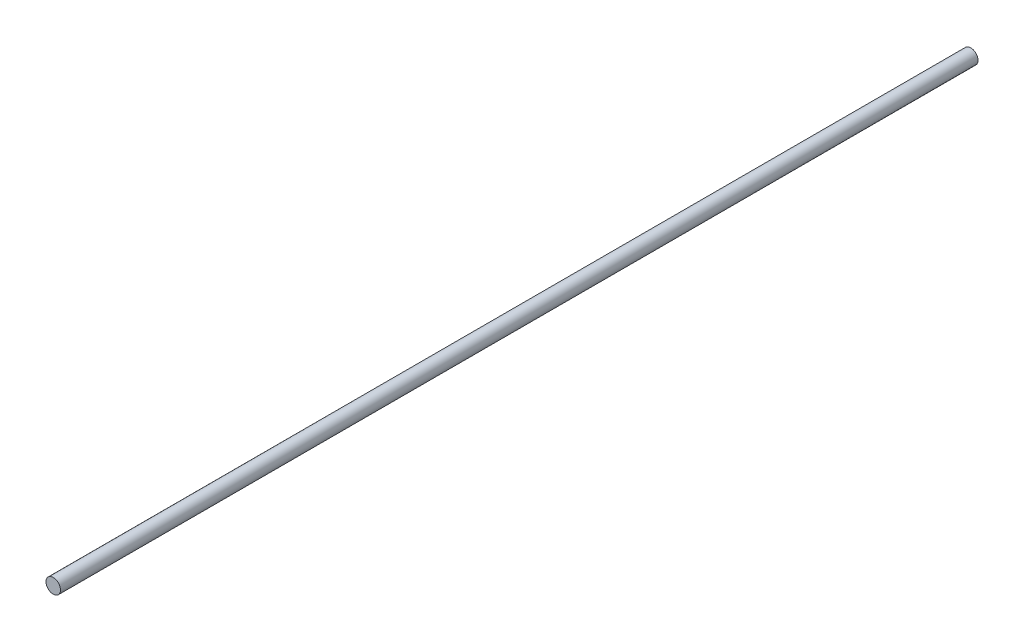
ISO-10303-21;
HEADER;
FILE_DESCRIPTION(('STEP AP214'),'2;1');
FILE_NAME('part.step','',(''),(''),'','','');
FILE_SCHEMA(('AUTOMOTIVE_DESIGN { 1 0 10303 214 1 1 1 1 }'));
ENDSEC;
DATA;
#1=APPLICATION_CONTEXT('core data for automotive mechanical design processes');
#2=APPLICATION_PROTOCOL_DEFINITION('international standard','automotive_design',2000,#1);
#3=PRODUCT_CONTEXT('',#1,'mechanical');
#4=PRODUCT('Part','Part','',(#3));
#5=PRODUCT_RELATED_PRODUCT_CATEGORY('part','',(#4));
#6=PRODUCT_DEFINITION_FORMATION('','',#4);
#7=PRODUCT_DEFINITION_CONTEXT('part definition',#1,'design');
#8=PRODUCT_DEFINITION('design','',#6,#7);
#9=PRODUCT_DEFINITION_SHAPE('','',#8);
#10=(LENGTH_UNIT() NAMED_UNIT(*) SI_UNIT(.MILLI.,.METRE.));
#11=(NAMED_UNIT(*) PLANE_ANGLE_UNIT() SI_UNIT($,.RADIAN.));
#12=(NAMED_UNIT(*) SI_UNIT($,.STERADIAN.) SOLID_ANGLE_UNIT());
#13=UNCERTAINTY_MEASURE_WITH_UNIT(LENGTH_MEASURE(1.E-05),#10,'distance_accuracy_value','');
#14=(GEOMETRIC_REPRESENTATION_CONTEXT(3) GLOBAL_UNCERTAINTY_ASSIGNED_CONTEXT((#13)) GLOBAL_UNIT_ASSIGNED_CONTEXT((#10,
#11,#12)) REPRESENTATION_CONTEXT('',''));
#15=CARTESIAN_POINT('',(0.,0.,0.));
#16=DIRECTION('',(0.,0.,1.));
#17=DIRECTION('',(1.,0.,0.));
#18=AXIS2_PLACEMENT_3D('',#15,#16,#17);
#19=CARTESIAN_POINT('',(0.,0.,-3800.));
#20=DIRECTION('',(0.,0.,1.));
#21=DIRECTION('',(1.,0.,0.));
#22=AXIS2_PLACEMENT_3D('',#19,#20,#21);
#23=CYLINDRICAL_SURFACE('',#22,30.);
#24=CARTESIAN_POINT('',(0.,0.,-3800.));
#25=DIRECTION('',(0.,0.,1.));
#26=DIRECTION('',(1.,0.,0.));
#27=AXIS2_PLACEMENT_3D('',#24,#25,#26);
#28=CIRCLE('',#27,30.);
#29=CARTESIAN_POINT('',(30.,0.,-3800.));
#30=VERTEX_POINT('',#29);
#31=EDGE_CURVE('E10',#30,#30,#28,.T.);
#32=CARTESIAN_POINT('',(0.,0.,0.));
#33=DIRECTION('',(0.,0.,1.));
#34=DIRECTION('',(1.,0.,0.));
#35=AXIS2_PLACEMENT_3D('',#32,#33,#34);
#36=CIRCLE('',#35,30.);
#37=CARTESIAN_POINT('',(30.,0.,-4.44089209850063E-13));
#38=VERTEX_POINT('',#37);
#39=EDGE_CURVE('E40',#38,#38,#36,.T.);
#40=CARTESIAN_POINT('',(30.,0.,-3800.));
#41=CARTESIAN_POINT('',(30.,0.,-3760.41666666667));
#42=CARTESIAN_POINT('',(30.,0.,-3720.83333333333));
#43=CARTESIAN_POINT('',(30.,0.,-3641.66666666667));
#44=CARTESIAN_POINT('',(30.,0.,-3602.08333333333));
#45=CARTESIAN_POINT('',(30.,0.,-3522.91666666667));
#46=CARTESIAN_POINT('',(30.,0.,-3483.33333333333));
#47=CARTESIAN_POINT('',(30.,0.,-3404.16666666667));
#48=CARTESIAN_POINT('',(30.,0.,-3364.58333333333));
#49=CARTESIAN_POINT('',(30.,0.,-3285.41666666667));
#50=CARTESIAN_POINT('',(30.,0.,-3245.83333333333));
#51=CARTESIAN_POINT('',(30.,0.,-3166.66666666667));
#52=CARTESIAN_POINT('',(30.,0.,-3127.08333333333));
#53=CARTESIAN_POINT('',(30.,0.,-3047.91666666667));
#54=CARTESIAN_POINT('',(30.,0.,-3008.33333333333));
#55=CARTESIAN_POINT('',(30.,0.,-2929.16666666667));
#56=CARTESIAN_POINT('',(30.,0.,-2889.58333333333));
#57=CARTESIAN_POINT('',(30.,0.,-2810.41666666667));
#58=CARTESIAN_POINT('',(30.,0.,-2770.83333333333));
#59=CARTESIAN_POINT('',(30.,0.,-2691.66666666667));
#60=CARTESIAN_POINT('',(30.,0.,-2652.08333333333));
#61=CARTESIAN_POINT('',(30.,0.,-2572.91666666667));
#62=CARTESIAN_POINT('',(30.,0.,-2533.33333333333));
#63=CARTESIAN_POINT('',(30.,0.,-2454.16666666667));
#64=CARTESIAN_POINT('',(30.,0.,-2414.58333333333));
#65=CARTESIAN_POINT('',(30.,0.,-2335.41666666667));
#66=CARTESIAN_POINT('',(30.,0.,-2295.83333333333));
#67=CARTESIAN_POINT('',(30.,0.,-2216.66666666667));
#68=CARTESIAN_POINT('',(30.,0.,-2177.08333333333));
#69=CARTESIAN_POINT('',(30.,0.,-2097.91666666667));
#70=CARTESIAN_POINT('',(30.,0.,-2058.33333333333));
#71=CARTESIAN_POINT('',(30.,0.,-1979.16666666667));
#72=CARTESIAN_POINT('',(30.,0.,-1939.58333333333));
#73=CARTESIAN_POINT('',(30.,0.,-1860.41666666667));
#74=CARTESIAN_POINT('',(30.,0.,-1820.83333333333));
#75=CARTESIAN_POINT('',(30.,0.,-1741.66666666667));
#76=CARTESIAN_POINT('',(30.,0.,-1702.08333333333));
#77=CARTESIAN_POINT('',(30.,0.,-1622.91666666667));
#78=CARTESIAN_POINT('',(30.,0.,-1583.33333333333));
#79=CARTESIAN_POINT('',(30.,0.,-1504.16666666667));
#80=CARTESIAN_POINT('',(30.,0.,-1464.58333333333));
#81=CARTESIAN_POINT('',(30.,0.,-1385.41666666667));
#82=CARTESIAN_POINT('',(30.,0.,-1345.83333333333));
#83=CARTESIAN_POINT('',(30.,0.,-1266.66666666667));
#84=CARTESIAN_POINT('',(30.,0.,-1227.08333333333));
#85=CARTESIAN_POINT('',(30.,0.,-1147.91666666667));
#86=CARTESIAN_POINT('',(30.,0.,-1108.33333333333));
#87=CARTESIAN_POINT('',(30.,0.,-1029.16666666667));
#88=CARTESIAN_POINT('',(30.,0.,-989.583333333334));
#89=CARTESIAN_POINT('',(30.,0.,-910.416666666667));
#90=CARTESIAN_POINT('',(30.,0.,-870.833333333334));
#91=CARTESIAN_POINT('',(30.,0.,-791.666666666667));
#92=CARTESIAN_POINT('',(30.,0.,-752.083333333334));
#93=CARTESIAN_POINT('',(30.,0.,-672.916666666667));
#94=CARTESIAN_POINT('',(30.,0.,-633.333333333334));
#95=CARTESIAN_POINT('',(30.,0.,-554.166666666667));
#96=CARTESIAN_POINT('',(30.,0.,-514.583333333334));
#97=CARTESIAN_POINT('',(30.,0.,-435.416666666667));
#98=CARTESIAN_POINT('',(30.,0.,-395.833333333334));
#99=CARTESIAN_POINT('',(30.,0.,-316.666666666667));
#100=CARTESIAN_POINT('',(30.,0.,-277.083333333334));
#101=CARTESIAN_POINT('',(30.,0.,-197.916666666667));
#102=CARTESIAN_POINT('',(30.,0.,-158.333333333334));
#103=CARTESIAN_POINT('',(30.,0.,-79.1666666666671));
#104=CARTESIAN_POINT('',(30.,0.,-39.5833333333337));
#105=CARTESIAN_POINT('',(30.,0.,-4.44089209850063E-13));
#106=B_SPLINE_CURVE_WITH_KNOTS('',3,(#40,#41,#42,#43,#44,#45,#46,#47,#48,#49,#50,#51,#52,#53,
#54,#55,#56,#57,#58,#59,#60,#61,#62,#63,#64,#65,#66,#67,#68,#69,#70,#71,#72,#73,#74,#75,#76,#77,
#78,#79,#80,#81,#82,#83,#84,#85,#86,#87,#88,#89,#90,#91,#92,#93,#94,#95,#96,#97,#98,#99,#100,
#101,#102,#103,#104,#105),.UNSPECIFIED.,.F.,.F.,(4,2,2,2,2,2,2,2,2,2,2,2,2,2,2,2,2,2,2,2,2,2,2,
2,2,2,2,2,2,2,2,2,4),(0.,118.75,237.5,356.25,475.,593.75,712.499999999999,831.25,950.,1068.75,
1187.5,1306.25,1425.,1543.75,1662.5,1781.25,1900.,2018.75,2137.5,2256.25,2375.,2493.75,2612.5,
2731.25,2850.,2968.75,3087.5,3206.25,3325.,3443.75,3562.5,3681.25,3800.),.UNSPECIFIED.);
#107=EDGE_CURVE('BSEAM37',#30,#38,#106,.T.);
#108=ORIENTED_EDGE('',*,*,#31,.T.);
#109=ORIENTED_EDGE('',*,*,#39,.F.);
#110=ORIENTED_EDGE('',*,*,#107,.T.);
#111=ORIENTED_EDGE('',*,*,#107,.F.);
#112=EDGE_LOOP('',(#108,#110,#109,#111));
#113=FACE_BOUND('',#112,.T.);
#114=ADVANCED_FACE('F37',(#113),#23,.T.);
#115=CARTESIAN_POINT('',(0.,0.,-3800.));
#116=DIRECTION('',(0.,0.,1.));
#117=DIRECTION('',(1.,0.,0.));
#118=AXIS2_PLACEMENT_3D('',#115,#116,#117);
#119=PLANE('',#118);
#120=ORIENTED_EDGE('',*,*,#31,.F.);
#121=EDGE_LOOP('',(#120));
#122=FACE_BOUND('',#121,.T.);
#123=ADVANCED_FACE('F54',(#122),#119,.F.);
#124=CARTESIAN_POINT('',(0.,0.,0.));
#125=DIRECTION('',(0.,0.,1.));
#126=DIRECTION('',(1.,0.,0.));
#127=AXIS2_PLACEMENT_3D('',#124,#125,#126);
#128=PLANE('',#127);
#129=ORIENTED_EDGE('',*,*,#39,.T.);
#130=EDGE_LOOP('',(#129));
#131=FACE_BOUND('',#130,.T.);
#132=ADVANCED_FACE('F51',(#131),#128,.T.);
#133=CLOSED_SHELL('',(#114,#123,#132));
#134=MANIFOLD_SOLID_BREP('B2',#133);
#135=ADVANCED_BREP_SHAPE_REPRESENTATION('',(#18,#134),#14);
#136=SHAPE_DEFINITION_REPRESENTATION(#9,#135);
ENDSEC;
END-ISO-10303-21;
